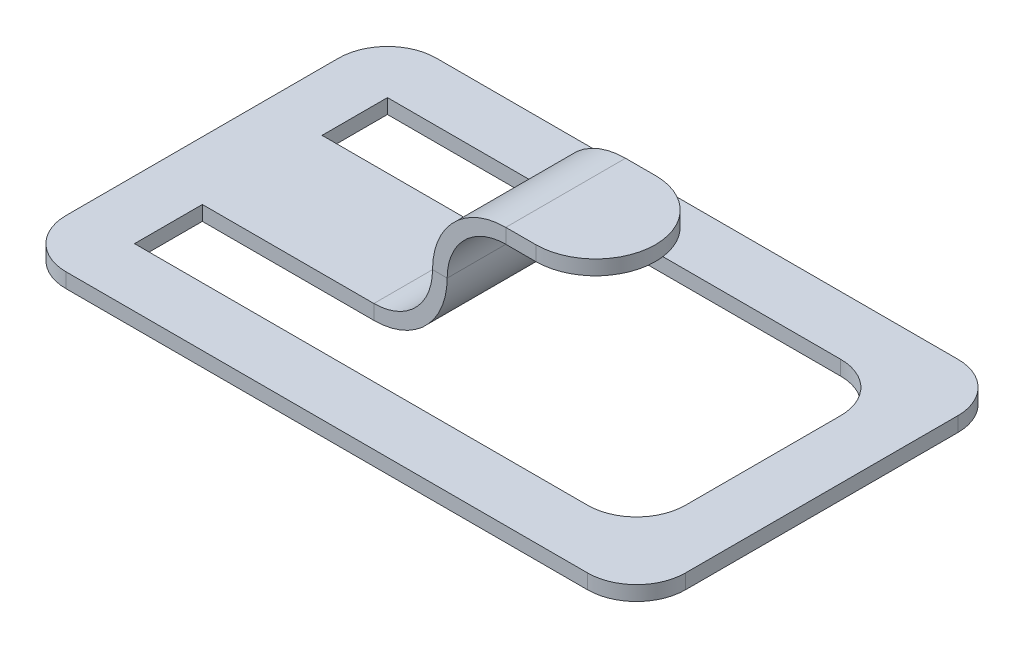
ISO-10303-21;
HEADER;
FILE_DESCRIPTION(('STEP AP214'),'2;1');
FILE_NAME('part.step','',(''),(''),'','','');
FILE_SCHEMA(('AUTOMOTIVE_DESIGN { 1 0 10303 214 1 1 1 1 }'));
ENDSEC;
DATA;
#1=APPLICATION_CONTEXT('core data for automotive mechanical design processes');
#2=APPLICATION_PROTOCOL_DEFINITION('international standard','automotive_design',2000,#1);
#3=PRODUCT_CONTEXT('',#1,'mechanical');
#4=PRODUCT('Part','Part','',(#3));
#5=PRODUCT_RELATED_PRODUCT_CATEGORY('part','',(#4));
#6=PRODUCT_DEFINITION_FORMATION('','',#4);
#7=PRODUCT_DEFINITION_CONTEXT('part definition',#1,'design');
#8=PRODUCT_DEFINITION('design','',#6,#7);
#9=PRODUCT_DEFINITION_SHAPE('','',#8);
#10=(LENGTH_UNIT() NAMED_UNIT(*) SI_UNIT(.MILLI.,.METRE.));
#11=(NAMED_UNIT(*) PLANE_ANGLE_UNIT() SI_UNIT($,.RADIAN.));
#12=(NAMED_UNIT(*) SI_UNIT($,.STERADIAN.) SOLID_ANGLE_UNIT());
#13=UNCERTAINTY_MEASURE_WITH_UNIT(LENGTH_MEASURE(1.E-05),#10,'distance_accuracy_value','');
#14=(GEOMETRIC_REPRESENTATION_CONTEXT(3) GLOBAL_UNCERTAINTY_ASSIGNED_CONTEXT((#13)) GLOBAL_UNIT_ASSIGNED_CONTEXT((#10,
#11,#12)) REPRESENTATION_CONTEXT('',''));
#15=CARTESIAN_POINT('',(0.,0.,0.));
#16=DIRECTION('',(0.,0.,1.));
#17=DIRECTION('',(1.,0.,0.));
#18=AXIS2_PLACEMENT_3D('',#15,#16,#17);
#19=CARTESIAN_POINT('',(12.,3.,-12.));
#20=DIRECTION('',(1.,0.,0.));
#21=DIRECTION('',(0.,0.,-1.));
#22=AXIS2_PLACEMENT_3D('',#19,#20,#21);
#23=PLANE('',#22);
#24=DIRECTION('',(0.,0.,1.));
#25=VECTOR('',#24,1.);
#26=CARTESIAN_POINT('',(12.,0.,-12.));
#27=LINE('',#26,#25);
#28=CARTESIAN_POINT('',(12.,0.,-25.889966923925));
#29=VERTEX_POINT('',#28);
#30=CARTESIAN_POINT('',(12.,0.,-12.));
#31=VERTEX_POINT('',#30);
#32=EDGE_CURVE('E293',#29,#31,#27,.T.);
#33=ORIENTED_EDGE('',*,*,#32,.F.);
#34=DIRECTION('',(0.,-1.,0.));
#35=VECTOR('',#34,1.);
#36=CARTESIAN_POINT('',(12.,3.,-25.889966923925));
#37=LINE('',#36,#35);
#38=CARTESIAN_POINT('',(12.,3.,-25.889966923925));
#39=VERTEX_POINT('',#38);
#40=EDGE_CURVE('E266',#39,#29,#37,.T.);
#41=ORIENTED_EDGE('',*,*,#40,.F.);
#42=DIRECTION('',(0.,0.,1.));
#43=VECTOR('',#42,1.);
#44=CARTESIAN_POINT('',(12.,3.,-12.));
#45=LINE('',#44,#43);
#46=CARTESIAN_POINT('',(12.,3.,-12.));
#47=VERTEX_POINT('',#46);
#48=EDGE_CURVE('E392',#39,#47,#45,.T.);
#49=ORIENTED_EDGE('',*,*,#48,.T.);
#50=DIRECTION('',(0.,-1.,0.));
#51=VECTOR('',#50,1.);
#52=CARTESIAN_POINT('',(12.,3.,-12.));
#53=LINE('',#52,#51);
#54=EDGE_CURVE('E390',#47,#31,#53,.T.);
#55=ORIENTED_EDGE('',*,*,#54,.T.);
#56=EDGE_LOOP('',(#33,#41,#49,#55));
#57=FACE_BOUND('',#56,.T.);
#58=ADVANCED_FACE('F39',(#57),#23,.T.);
#59=CARTESIAN_POINT('',(12.,3.,-12.));
#60=DIRECTION('',(0.,0.,-1.));
#61=DIRECTION('',(-1.,0.,0.));
#62=AXIS2_PLACEMENT_3D('',#59,#60,#61);
#63=PLANE('',#62);
#64=DIRECTION('',(1.,0.,0.));
#65=VECTOR('',#64,1.);
#66=CARTESIAN_POINT('',(12.,0.,-12.));
#67=LINE('',#66,#65);
#68=CARTESIAN_POINT('',(104.761962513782,0.,-12.));
#69=VERTEX_POINT('',#68);
#70=EDGE_CURVE('E290',#31,#69,#67,.T.);
#71=ORIENTED_EDGE('',*,*,#70,.F.);
#72=ORIENTED_EDGE('',*,*,#54,.F.);
#73=DIRECTION('',(1.,0.,0.));
#74=VECTOR('',#73,1.);
#75=CARTESIAN_POINT('',(12.,3.,-12.));
#76=LINE('',#75,#74);
#77=CARTESIAN_POINT('',(104.761962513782,3.,-12.));
#78=VERTEX_POINT('',#77);
#79=EDGE_CURVE('E388',#47,#78,#76,.T.);
#80=ORIENTED_EDGE('',*,*,#79,.T.);
#81=DIRECTION('',(0.,-1.,0.));
#82=VECTOR('',#81,1.);
#83=CARTESIAN_POINT('',(104.761962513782,3.,-12.));
#84=LINE('',#83,#82);
#85=EDGE_CURVE('E386',#78,#69,#84,.T.);
#86=ORIENTED_EDGE('',*,*,#85,.T.);
#87=EDGE_LOOP('',(#71,#72,#80,#86));
#88=FACE_BOUND('',#87,.T.);
#89=ADVANCED_FACE('F440',(#88),#63,.T.);
#90=CARTESIAN_POINT('',(104.761962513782,3.,-22.));
#91=DIRECTION('',(0.,-1.,0.));
#92=DIRECTION('',(0.,0.,-1.));
#93=AXIS2_PLACEMENT_3D('',#90,#91,#92);
#94=CYLINDRICAL_SURFACE('',#93,10.);
#95=CARTESIAN_POINT('',(104.761962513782,0.,-22.));
#96=DIRECTION('',(0.,1.,0.));
#97=DIRECTION('',(0.,0.,1.));
#98=AXIS2_PLACEMENT_3D('',#95,#96,#97);
#99=CIRCLE('',#98,10.);
#100=CARTESIAN_POINT('',(114.761962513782,0.,-22.0000000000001));
#101=VERTEX_POINT('',#100);
#102=EDGE_CURVE('E287',#69,#101,#99,.T.);
#103=ORIENTED_EDGE('',*,*,#102,.F.);
#104=ORIENTED_EDGE('',*,*,#85,.F.);
#105=CARTESIAN_POINT('',(104.761962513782,3.,-22.));
#106=DIRECTION('',(0.,1.,0.));
#107=DIRECTION('',(0.,0.,1.));
#108=AXIS2_PLACEMENT_3D('',#105,#106,#107);
#109=CIRCLE('',#108,10.);
#110=CARTESIAN_POINT('',(114.761962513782,3.,-22.0000000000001));
#111=VERTEX_POINT('',#110);
#112=EDGE_CURVE('E384',#78,#111,#109,.T.);
#113=ORIENTED_EDGE('',*,*,#112,.T.);
#114=DIRECTION('',(0.,-1.,0.));
#115=VECTOR('',#114,1.);
#116=CARTESIAN_POINT('',(114.761962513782,3.,-22.0000000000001));
#117=LINE('',#116,#115);
#118=EDGE_CURVE('E382',#111,#101,#117,.T.);
#119=ORIENTED_EDGE('',*,*,#118,.T.);
#120=EDGE_LOOP('',(#103,#104,#113,#119));
#121=FACE_BOUND('',#120,.T.);
#122=ADVANCED_FACE('F446',(#121),#94,.F.);
#123=CARTESIAN_POINT('',(114.761962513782,3.,-22.0000000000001));
#124=DIRECTION('',(-1.,0.,0.));
#125=DIRECTION('',(0.,0.,1.));
#126=AXIS2_PLACEMENT_3D('',#123,#124,#125);
#127=PLANE('',#126);
#128=DIRECTION('',(0.,0.,-1.));
#129=VECTOR('',#128,1.);
#130=CARTESIAN_POINT('',(114.761962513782,0.,-22.0000000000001));
#131=LINE('',#130,#129);
#132=CARTESIAN_POINT('',(114.761962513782,0.,-53.77993384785));
#133=VERTEX_POINT('',#132);
#134=EDGE_CURVE('E284',#101,#133,#131,.T.);
#135=ORIENTED_EDGE('',*,*,#134,.F.);
#136=ORIENTED_EDGE('',*,*,#118,.F.);
#137=DIRECTION('',(0.,0.,-1.));
#138=VECTOR('',#137,1.);
#139=CARTESIAN_POINT('',(114.761962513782,3.,-22.0000000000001));
#140=LINE('',#139,#138);
#141=CARTESIAN_POINT('',(114.761962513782,3.,-53.77993384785));
#142=VERTEX_POINT('',#141);
#143=EDGE_CURVE('E380',#111,#142,#140,.T.);
#144=ORIENTED_EDGE('',*,*,#143,.T.);
#145=DIRECTION('',(0.,-1.,0.));
#146=VECTOR('',#145,1.);
#147=CARTESIAN_POINT('',(114.761962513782,3.,-53.77993384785));
#148=LINE('',#147,#146);
#149=EDGE_CURVE('E378',#142,#133,#148,.T.);
#150=ORIENTED_EDGE('',*,*,#149,.T.);
#151=EDGE_LOOP('',(#135,#136,#144,#150));
#152=FACE_BOUND('',#151,.T.);
#153=ADVANCED_FACE('F453',(#152),#127,.T.);
#154=CARTESIAN_POINT('',(104.761962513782,3.,-53.7799338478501));
#155=DIRECTION('',(0.,-1.,0.));
#156=DIRECTION('',(0.,0.,-1.));
#157=AXIS2_PLACEMENT_3D('',#154,#155,#156);
#158=CYLINDRICAL_SURFACE('',#157,10.);
#159=CARTESIAN_POINT('',(104.761962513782,0.,-53.7799338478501));
#160=DIRECTION('',(0.,1.,0.));
#161=DIRECTION('',(0.,0.,1.));
#162=AXIS2_PLACEMENT_3D('',#159,#160,#161);
#163=CIRCLE('',#162,10.);
#164=CARTESIAN_POINT('',(104.761962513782,0.,-63.7799338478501));
#165=VERTEX_POINT('',#164);
#166=EDGE_CURVE('E281',#133,#165,#163,.T.);
#167=ORIENTED_EDGE('',*,*,#166,.F.);
#168=ORIENTED_EDGE('',*,*,#149,.F.);
#169=CARTESIAN_POINT('',(104.761962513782,3.,-53.7799338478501));
#170=DIRECTION('',(0.,1.,0.));
#171=DIRECTION('',(0.,0.,1.));
#172=AXIS2_PLACEMENT_3D('',#169,#170,#171);
#173=CIRCLE('',#172,10.);
#174=CARTESIAN_POINT('',(104.761962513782,3.,-63.7799338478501));
#175=VERTEX_POINT('',#174);
#176=EDGE_CURVE('E375',#142,#175,#173,.T.);
#177=ORIENTED_EDGE('',*,*,#176,.T.);
#178=DIRECTION('',(0.,-1.,0.));
#179=VECTOR('',#178,1.);
#180=CARTESIAN_POINT('',(104.761962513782,3.,-63.7799338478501));
#181=LINE('',#180,#179);
#182=EDGE_CURVE('E373',#175,#165,#181,.T.);
#183=ORIENTED_EDGE('',*,*,#182,.T.);
#184=EDGE_LOOP('',(#167,#168,#177,#183));
#185=FACE_BOUND('',#184,.T.);
#186=ADVANCED_FACE('F457',(#185),#158,.F.);
#187=CARTESIAN_POINT('',(12.,3.,-63.7799338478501));
#188=DIRECTION('',(0.,0.,1.));
#189=DIRECTION('',(1.,0.,0.));
#190=AXIS2_PLACEMENT_3D('',#187,#188,#189);
#191=PLANE('',#190);
#192=DIRECTION('',(-1.,0.,0.));
#193=VECTOR('',#192,1.);
#194=CARTESIAN_POINT('',(12.,0.,-63.7799338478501));
#195=LINE('',#194,#193);
#196=CARTESIAN_POINT('',(12.,0.,-63.7799338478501));
#197=VERTEX_POINT('',#196);
#198=EDGE_CURVE('E278',#165,#197,#195,.T.);
#199=ORIENTED_EDGE('',*,*,#198,.F.);
#200=ORIENTED_EDGE('',*,*,#182,.F.);
#201=DIRECTION('',(-1.,0.,0.));
#202=VECTOR('',#201,1.);
#203=CARTESIAN_POINT('',(12.,3.,-63.7799338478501));
#204=LINE('',#203,#202);
#205=CARTESIAN_POINT('',(12.,3.,-63.7799338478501));
#206=VERTEX_POINT('',#205);
#207=EDGE_CURVE('E371',#175,#206,#204,.T.);
#208=ORIENTED_EDGE('',*,*,#207,.T.);
#209=DIRECTION('',(0.,-1.,0.));
#210=VECTOR('',#209,1.);
#211=CARTESIAN_POINT('',(12.,3.,-63.7799338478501));
#212=LINE('',#211,#210);
#213=EDGE_CURVE('E368',#206,#197,#212,.T.);
#214=ORIENTED_EDGE('',*,*,#213,.T.);
#215=EDGE_LOOP('',(#199,#200,#208,#214));
#216=FACE_BOUND('',#215,.T.);
#217=ADVANCED_FACE('F461',(#216),#191,.T.);
#218=CARTESIAN_POINT('',(12.,3.,-50.3908410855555));
#219=DIRECTION('',(1.,0.,0.));
#220=DIRECTION('',(0.,0.,-1.));
#221=AXIS2_PLACEMENT_3D('',#218,#219,#220);
#222=PLANE('',#221);
#223=DIRECTION('',(0.,0.,1.));
#224=VECTOR('',#223,1.);
#225=CARTESIAN_POINT('',(12.,0.,-50.3908410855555));
#226=LINE('',#225,#224);
#227=CARTESIAN_POINT('',(12.,0.,-50.3908410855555));
#228=VERTEX_POINT('',#227);
#229=EDGE_CURVE('E275',#197,#228,#226,.T.);
#230=ORIENTED_EDGE('',*,*,#229,.F.);
#231=ORIENTED_EDGE('',*,*,#213,.F.);
#232=DIRECTION('',(0.,0.,1.));
#233=VECTOR('',#232,1.);
#234=CARTESIAN_POINT('',(12.,3.,-50.3908410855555));
#235=LINE('',#234,#233);
#236=CARTESIAN_POINT('',(12.,3.,-50.3908410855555));
#237=VERTEX_POINT('',#236);
#238=EDGE_CURVE('E366',#206,#237,#235,.T.);
#239=ORIENTED_EDGE('',*,*,#238,.T.);
#240=DIRECTION('',(0.,-1.,0.));
#241=VECTOR('',#240,1.);
#242=CARTESIAN_POINT('',(12.,3.,-50.3908410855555));
#243=LINE('',#242,#241);
#244=EDGE_CURVE('E363',#237,#228,#243,.T.);
#245=ORIENTED_EDGE('',*,*,#244,.T.);
#246=EDGE_LOOP('',(#230,#231,#239,#245));
#247=FACE_BOUND('',#246,.T.);
#248=ADVANCED_FACE('F465',(#247),#222,.T.);
#249=CARTESIAN_POINT('',(126.761962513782,3.,-10.0000000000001));
#250=DIRECTION('',(-1.,0.,0.));
#251=DIRECTION('',(0.,0.,1.));
#252=AXIS2_PLACEMENT_3D('',#249,#250,#251);
#253=PLANE('',#252);
#254=DIRECTION('',(0.,0.,-1.));
#255=VECTOR('',#254,1.);
#256=CARTESIAN_POINT('',(126.761962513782,0.,-10.0000000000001));
#257=LINE('',#256,#255);
#258=CARTESIAN_POINT('',(126.761962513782,0.,-10.0000000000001));
#259=VERTEX_POINT('',#258);
#260=CARTESIAN_POINT('',(126.761962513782,0.,-65.77993384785));
#261=VERTEX_POINT('',#260);
#262=EDGE_CURVE('E361',#259,#261,#257,.T.);
#263=ORIENTED_EDGE('',*,*,#262,.T.);
#264=DIRECTION('',(0.,-1.,0.));
#265=VECTOR('',#264,1.);
#266=CARTESIAN_POINT('',(126.761962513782,3.,-65.77993384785));
#267=LINE('',#266,#265);
#268=CARTESIAN_POINT('',(126.761962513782,3.,-65.77993384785));
#269=VERTEX_POINT('',#268);
#270=EDGE_CURVE('E322',#269,#261,#267,.T.);
#271=ORIENTED_EDGE('',*,*,#270,.F.);
#272=DIRECTION('',(0.,0.,-1.));
#273=VECTOR('',#272,1.);
#274=CARTESIAN_POINT('',(126.761962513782,3.,-10.0000000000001));
#275=LINE('',#274,#273);
#276=CARTESIAN_POINT('',(126.761962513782,3.,-10.0000000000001));
#277=VERTEX_POINT('',#276);
#278=EDGE_CURVE('E305',#277,#269,#275,.T.);
#279=ORIENTED_EDGE('',*,*,#278,.F.);
#280=DIRECTION('',(0.,-1.,0.));
#281=VECTOR('',#280,1.);
#282=CARTESIAN_POINT('',(126.761962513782,3.,-10.0000000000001));
#283=LINE('',#282,#281);
#284=EDGE_CURVE('E358',#277,#259,#283,.T.);
#285=ORIENTED_EDGE('',*,*,#284,.T.);
#286=EDGE_LOOP('',(#263,#271,#279,#285));
#287=FACE_BOUND('',#286,.T.);
#288=ADVANCED_FACE('F469',(#287),#253,.F.);
#289=CARTESIAN_POINT('',(116.761962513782,3.,-10.));
#290=DIRECTION('',(0.,-1.,0.));
#291=DIRECTION('',(0.,0.,-1.));
#292=AXIS2_PLACEMENT_3D('',#289,#290,#291);
#293=CYLINDRICAL_SURFACE('',#292,10.);
#294=CARTESIAN_POINT('',(116.761962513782,0.,-10.));
#295=DIRECTION('',(0.,1.,0.));
#296=DIRECTION('',(0.,0.,1.));
#297=AXIS2_PLACEMENT_3D('',#294,#295,#296);
#298=CIRCLE('',#297,10.);
#299=CARTESIAN_POINT('',(116.761962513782,0.,0.));
#300=VERTEX_POINT('',#299);
#301=EDGE_CURVE('E356',#300,#259,#298,.T.);
#302=ORIENTED_EDGE('',*,*,#301,.T.);
#303=ORIENTED_EDGE('',*,*,#284,.F.);
#304=CARTESIAN_POINT('',(116.761962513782,3.,-10.));
#305=DIRECTION('',(0.,1.,0.));
#306=DIRECTION('',(0.,0.,1.));
#307=AXIS2_PLACEMENT_3D('',#304,#305,#306);
#308=CIRCLE('',#307,10.);
#309=CARTESIAN_POINT('',(116.761962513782,3.,0.));
#310=VERTEX_POINT('',#309);
#311=EDGE_CURVE('E307',#310,#277,#308,.T.);
#312=ORIENTED_EDGE('',*,*,#311,.F.);
#313=DIRECTION('',(0.,-1.,0.));
#314=VECTOR('',#313,1.);
#315=CARTESIAN_POINT('',(116.761962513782,3.,0.));
#316=LINE('',#315,#314);
#317=EDGE_CURVE('E353',#310,#300,#316,.T.);
#318=ORIENTED_EDGE('',*,*,#317,.T.);
#319=EDGE_LOOP('',(#302,#303,#312,#318));
#320=FACE_BOUND('',#319,.T.);
#321=ADVANCED_FACE('F473',(#320),#293,.T.);
#322=CARTESIAN_POINT('',(10.0000000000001,3.,0.));
#323=DIRECTION('',(0.,0.,-1.));
#324=DIRECTION('',(-1.,0.,0.));
#325=AXIS2_PLACEMENT_3D('',#322,#323,#324);
#326=PLANE('',#325);
#327=DIRECTION('',(1.,0.,0.));
#328=VECTOR('',#327,1.);
#329=CARTESIAN_POINT('',(10.0000000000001,0.,0.));
#330=LINE('',#329,#328);
#331=CARTESIAN_POINT('',(10.0000000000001,0.,0.));
#332=VERTEX_POINT('',#331);
#333=EDGE_CURVE('E351',#332,#300,#330,.T.);
#334=ORIENTED_EDGE('',*,*,#333,.T.);
#335=ORIENTED_EDGE('',*,*,#317,.F.);
#336=DIRECTION('',(1.,0.,0.));
#337=VECTOR('',#336,1.);
#338=CARTESIAN_POINT('',(10.0000000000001,3.,0.));
#339=LINE('',#338,#337);
#340=CARTESIAN_POINT('',(10.0000000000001,3.,0.));
#341=VERTEX_POINT('',#340);
#342=EDGE_CURVE('E309',#341,#310,#339,.T.);
#343=ORIENTED_EDGE('',*,*,#342,.F.);
#344=DIRECTION('',(0.,-1.,0.));
#345=VECTOR('',#344,1.);
#346=CARTESIAN_POINT('',(10.0000000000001,3.,0.));
#347=LINE('',#346,#345);
#348=EDGE_CURVE('E348',#341,#332,#347,.T.);
#349=ORIENTED_EDGE('',*,*,#348,.T.);
#350=EDGE_LOOP('',(#334,#335,#343,#349));
#351=FACE_BOUND('',#350,.T.);
#352=ADVANCED_FACE('F477',(#351),#326,.F.);
#353=CARTESIAN_POINT('',(10.,3.,-10.));
#354=DIRECTION('',(0.,-1.,0.));
#355=DIRECTION('',(0.,0.,-1.));
#356=AXIS2_PLACEMENT_3D('',#353,#354,#355);
#357=CYLINDRICAL_SURFACE('',#356,10.);
#358=CARTESIAN_POINT('',(10.,0.,-10.));
#359=DIRECTION('',(0.,1.,0.));
#360=DIRECTION('',(0.,0.,-1.));
#361=AXIS2_PLACEMENT_3D('',#358,#359,#360);
#362=CIRCLE('',#361,10.);
#363=CARTESIAN_POINT('',(0.,0.,-10.0000000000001));
#364=VERTEX_POINT('',#363);
#365=EDGE_CURVE('E346',#364,#332,#362,.T.);
#366=ORIENTED_EDGE('',*,*,#365,.T.);
#367=ORIENTED_EDGE('',*,*,#348,.F.);
#368=CARTESIAN_POINT('',(10.,3.,-10.));
#369=DIRECTION('',(0.,1.,0.));
#370=DIRECTION('',(0.,0.,-1.));
#371=AXIS2_PLACEMENT_3D('',#368,#369,#370);
#372=CIRCLE('',#371,10.);
#373=CARTESIAN_POINT('',(0.,3.,-10.0000000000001));
#374=VERTEX_POINT('',#373);
#375=EDGE_CURVE('E311',#374,#341,#372,.T.);
#376=ORIENTED_EDGE('',*,*,#375,.F.);
#377=DIRECTION('',(0.,-1.,0.));
#378=VECTOR('',#377,1.);
#379=CARTESIAN_POINT('',(0.,3.,-10.0000000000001));
#380=LINE('',#379,#378);
#381=EDGE_CURVE('E343',#374,#364,#380,.T.);
#382=ORIENTED_EDGE('',*,*,#381,.T.);
#383=EDGE_LOOP('',(#366,#367,#376,#382));
#384=FACE_BOUND('',#383,.T.);
#385=ADVANCED_FACE('F481',(#384),#357,.T.);
#386=CARTESIAN_POINT('',(0.,3.,-10.0000000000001));
#387=DIRECTION('',(1.,0.,0.));
#388=DIRECTION('',(0.,0.,-1.));
#389=AXIS2_PLACEMENT_3D('',#386,#387,#388);
#390=PLANE('',#389);
#391=DIRECTION('',(0.,0.,1.));
#392=VECTOR('',#391,1.);
#393=CARTESIAN_POINT('',(0.,0.,-10.0000000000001));
#394=LINE('',#393,#392);
#395=CARTESIAN_POINT('',(0.,0.,-65.77993384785));
#396=VERTEX_POINT('',#395);
#397=EDGE_CURVE('E341',#396,#364,#394,.T.);
#398=ORIENTED_EDGE('',*,*,#397,.T.);
#399=ORIENTED_EDGE('',*,*,#381,.F.);
#400=DIRECTION('',(0.,0.,1.));
#401=VECTOR('',#400,1.);
#402=CARTESIAN_POINT('',(0.,3.,-10.0000000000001));
#403=LINE('',#402,#401);
#404=CARTESIAN_POINT('',(0.,3.,-65.77993384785));
#405=VERTEX_POINT('',#404);
#406=EDGE_CURVE('E313',#405,#374,#403,.T.);
#407=ORIENTED_EDGE('',*,*,#406,.F.);
#408=DIRECTION('',(0.,-1.,0.));
#409=VECTOR('',#408,1.);
#410=CARTESIAN_POINT('',(0.,3.,-65.77993384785));
#411=LINE('',#410,#409);
#412=EDGE_CURVE('E338',#405,#396,#411,.T.);
#413=ORIENTED_EDGE('',*,*,#412,.T.);
#414=EDGE_LOOP('',(#398,#399,#407,#413));
#415=FACE_BOUND('',#414,.T.);
#416=ADVANCED_FACE('F485',(#415),#390,.F.);
#417=CARTESIAN_POINT('',(10.,3.,-65.7799338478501));
#418=DIRECTION('',(0.,-1.,0.));
#419=DIRECTION('',(0.,0.,-1.));
#420=AXIS2_PLACEMENT_3D('',#417,#418,#419);
#421=CYLINDRICAL_SURFACE('',#420,10.);
#422=CARTESIAN_POINT('',(10.,0.,-65.7799338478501));
#423=DIRECTION('',(0.,1.,0.));
#424=DIRECTION('',(0.,0.,-1.));
#425=AXIS2_PLACEMENT_3D('',#422,#423,#424);
#426=CIRCLE('',#425,10.);
#427=CARTESIAN_POINT('',(10.0000000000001,0.,-75.7799338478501));
#428=VERTEX_POINT('',#427);
#429=EDGE_CURVE('E336',#428,#396,#426,.T.);
#430=ORIENTED_EDGE('',*,*,#429,.T.);
#431=ORIENTED_EDGE('',*,*,#412,.F.);
#432=CARTESIAN_POINT('',(10.,3.,-65.7799338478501));
#433=DIRECTION('',(0.,1.,0.));
#434=DIRECTION('',(0.,0.,-1.));
#435=AXIS2_PLACEMENT_3D('',#432,#433,#434);
#436=CIRCLE('',#435,10.);
#437=CARTESIAN_POINT('',(10.0000000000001,3.,-75.7799338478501));
#438=VERTEX_POINT('',#437);
#439=EDGE_CURVE('E315',#438,#405,#436,.T.);
#440=ORIENTED_EDGE('',*,*,#439,.F.);
#441=DIRECTION('',(0.,-1.,0.));
#442=VECTOR('',#441,1.);
#443=CARTESIAN_POINT('',(10.0000000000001,3.,-75.7799338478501));
#444=LINE('',#443,#442);
#445=EDGE_CURVE('E333',#438,#428,#444,.T.);
#446=ORIENTED_EDGE('',*,*,#445,.T.);
#447=EDGE_LOOP('',(#430,#431,#440,#446));
#448=FACE_BOUND('',#447,.T.);
#449=ADVANCED_FACE('F489',(#448),#421,.T.);
#450=CARTESIAN_POINT('',(10.0000000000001,3.,-75.7799338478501));
#451=DIRECTION('',(0.,0.,1.));
#452=DIRECTION('',(1.,0.,0.));
#453=AXIS2_PLACEMENT_3D('',#450,#451,#452);
#454=PLANE('',#453);
#455=DIRECTION('',(-1.,0.,0.));
#456=VECTOR('',#455,1.);
#457=CARTESIAN_POINT('',(10.0000000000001,0.,-75.7799338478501));
#458=LINE('',#457,#456);
#459=CARTESIAN_POINT('',(116.761962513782,0.,-75.7799338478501));
#460=VERTEX_POINT('',#459);
#461=EDGE_CURVE('E331',#460,#428,#458,.T.);
#462=ORIENTED_EDGE('',*,*,#461,.T.);
#463=ORIENTED_EDGE('',*,*,#445,.F.);
#464=DIRECTION('',(-1.,0.,0.));
#465=VECTOR('',#464,1.);
#466=CARTESIAN_POINT('',(10.0000000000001,3.,-75.7799338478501));
#467=LINE('',#466,#465);
#468=CARTESIAN_POINT('',(116.761962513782,3.,-75.7799338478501));
#469=VERTEX_POINT('',#468);
#470=EDGE_CURVE('E317',#469,#438,#467,.T.);
#471=ORIENTED_EDGE('',*,*,#470,.F.);
#472=DIRECTION('',(0.,-1.,0.));
#473=VECTOR('',#472,1.);
#474=CARTESIAN_POINT('',(116.761962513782,3.,-75.7799338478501));
#475=LINE('',#474,#473);
#476=EDGE_CURVE('E328',#469,#460,#475,.T.);
#477=ORIENTED_EDGE('',*,*,#476,.T.);
#478=EDGE_LOOP('',(#462,#463,#471,#477));
#479=FACE_BOUND('',#478,.T.);
#480=ADVANCED_FACE('F493',(#479),#454,.F.);
#481=CARTESIAN_POINT('',(116.761962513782,3.,-65.7799338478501));
#482=DIRECTION('',(0.,-1.,0.));
#483=DIRECTION('',(0.,0.,-1.));
#484=AXIS2_PLACEMENT_3D('',#481,#482,#483);
#485=CYLINDRICAL_SURFACE('',#484,9.99999999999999);
#486=CARTESIAN_POINT('',(116.761962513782,0.,-65.7799338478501));
#487=DIRECTION('',(0.,1.,0.));
#488=DIRECTION('',(0.,0.,1.));
#489=AXIS2_PLACEMENT_3D('',#486,#487,#488);
#490=CIRCLE('',#489,9.99999999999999);
#491=EDGE_CURVE('E325',#261,#460,#490,.T.);
#492=ORIENTED_EDGE('',*,*,#491,.T.);
#493=ORIENTED_EDGE('',*,*,#476,.F.);
#494=CARTESIAN_POINT('',(116.761962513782,3.,-65.7799338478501));
#495=DIRECTION('',(0.,1.,0.));
#496=DIRECTION('',(0.,0.,1.));
#497=AXIS2_PLACEMENT_3D('',#494,#495,#496);
#498=CIRCLE('',#497,9.99999999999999);
#499=EDGE_CURVE('E319',#269,#469,#498,.T.);
#500=ORIENTED_EDGE('',*,*,#499,.F.);
#501=ORIENTED_EDGE('',*,*,#270,.T.);
#502=EDGE_LOOP('',(#492,#493,#500,#501));
#503=FACE_BOUND('',#502,.T.);
#504=ADVANCED_FACE('F497',(#503),#485,.T.);
#505=CARTESIAN_POINT('',(116.761962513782,3.,-65.7799338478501));
#506=DIRECTION('',(0.,1.,0.));
#507=DIRECTION('',(0.,0.,1.));
#508=AXIS2_PLACEMENT_3D('',#505,#506,#507);
#509=PLANE('',#508);
#510=ORIENTED_EDGE('',*,*,#499,.T.);
#511=ORIENTED_EDGE('',*,*,#470,.T.);
#512=ORIENTED_EDGE('',*,*,#439,.T.);
#513=ORIENTED_EDGE('',*,*,#406,.T.);
#514=ORIENTED_EDGE('',*,*,#375,.T.);
#515=ORIENTED_EDGE('',*,*,#342,.T.);
#516=ORIENTED_EDGE('',*,*,#311,.T.);
#517=ORIENTED_EDGE('',*,*,#278,.T.);
#518=EDGE_LOOP('',(#510,#511,#512,#513,#514,#515,#516,#517));
#519=FACE_BOUND('',#518,.T.);
#520=DIRECTION('',(-1.,0.,0.));
#521=VECTOR('',#520,1.);
#522=CARTESIAN_POINT('',(12.,3.,-25.889966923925));
#523=LINE('',#522,#521);
#524=CARTESIAN_POINT('',(47.1115981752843,2.99999996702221,-25.889966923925));
#525=VERTEX_POINT('',#524);
#526=EDGE_CURVE('E62',#525,#39,#523,.T.);
#527=ORIENTED_EDGE('',*,*,#526,.F.);
#528=DIRECTION('',(0.,0.,-1.));
#529=VECTOR('',#528,1.);
#530=CARTESIAN_POINT('',(47.1115981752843,3.,-65.7799338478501));
#531=LINE('',#530,#529);
#532=CARTESIAN_POINT('',(47.1115981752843,2.99999996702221,-50.3908410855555));
#533=VERTEX_POINT('',#532);
#534=EDGE_CURVE('E173',#525,#533,#531,.T.);
#535=ORIENTED_EDGE('',*,*,#534,.T.);
#536=DIRECTION('',(1.,0.,0.));
#537=VECTOR('',#536,1.);
#538=CARTESIAN_POINT('',(12.,3.,-50.3908410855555));
#539=LINE('',#538,#537);
#540=EDGE_CURVE('E301',#237,#533,#539,.T.);
#541=ORIENTED_EDGE('',*,*,#540,.F.);
#542=ORIENTED_EDGE('',*,*,#238,.F.);
#543=ORIENTED_EDGE('',*,*,#207,.F.);
#544=ORIENTED_EDGE('',*,*,#176,.F.);
#545=ORIENTED_EDGE('',*,*,#143,.F.);
#546=ORIENTED_EDGE('',*,*,#112,.F.);
#547=ORIENTED_EDGE('',*,*,#79,.F.);
#548=ORIENTED_EDGE('',*,*,#48,.F.);
#549=EDGE_LOOP('',(#527,#535,#541,#542,#543,#544,#545,#546,#547,#548));
#550=FACE_BOUND('',#549,.T.);
#551=ADVANCED_FACE('F501',(#519,#550),#509,.T.);
#552=CARTESIAN_POINT('',(12.,3.,-50.3908410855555));
#553=DIRECTION('',(0.,0.,-1.));
#554=DIRECTION('',(-1.,0.,0.));
#555=AXIS2_PLACEMENT_3D('',#552,#553,#554);
#556=PLANE('',#555);
#557=ORIENTED_EDGE('',*,*,#540,.T.);
#558=DIRECTION('',(0.,-1.,0.));
#559=VECTOR('',#558,1.);
#560=CARTESIAN_POINT('',(47.1115981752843,3.,-50.3908410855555));
#561=LINE('',#560,#559);
#562=CARTESIAN_POINT('',(47.1115981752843,0.,-50.3908410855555));
#563=VERTEX_POINT('',#562);
#564=EDGE_CURVE('E298',#533,#563,#561,.T.);
#565=ORIENTED_EDGE('',*,*,#564,.T.);
#566=DIRECTION('',(1.,0.,0.));
#567=VECTOR('',#566,1.);
#568=CARTESIAN_POINT('',(12.,0.,-50.3908410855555));
#569=LINE('',#568,#567);
#570=EDGE_CURVE('E272',#228,#563,#569,.T.);
#571=ORIENTED_EDGE('',*,*,#570,.F.);
#572=ORIENTED_EDGE('',*,*,#244,.F.);
#573=EDGE_LOOP('',(#557,#565,#571,#572));
#574=FACE_BOUND('',#573,.T.);
#575=ADVANCED_FACE('F505',(#574),#556,.T.);
#576=CARTESIAN_POINT('',(116.761962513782,0.,-65.7799338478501));
#577=DIRECTION('',(0.,1.,0.));
#578=DIRECTION('',(0.,0.,1.));
#579=AXIS2_PLACEMENT_3D('',#576,#577,#578);
#580=PLANE('',#579);
#581=DIRECTION('',(0.,0.,-1.));
#582=VECTOR('',#581,1.);
#583=CARTESIAN_POINT('',(47.1115981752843,0.,-65.7799338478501));
#584=LINE('',#583,#582);
#585=CARTESIAN_POINT('',(47.1115981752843,-3.29777906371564E-08,-25.889966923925));
#586=VERTEX_POINT('',#585);
#587=EDGE_CURVE('E262',#586,#563,#584,.T.);
#588=ORIENTED_EDGE('',*,*,#587,.F.);
#589=DIRECTION('',(-1.,0.,0.));
#590=VECTOR('',#589,1.);
#591=CARTESIAN_POINT('',(12.,0.,-25.889966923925));
#592=LINE('',#591,#590);
#593=EDGE_CURVE('E296',#586,#29,#592,.T.);
#594=ORIENTED_EDGE('',*,*,#593,.T.);
#595=ORIENTED_EDGE('',*,*,#32,.T.);
#596=ORIENTED_EDGE('',*,*,#70,.T.);
#597=ORIENTED_EDGE('',*,*,#102,.T.);
#598=ORIENTED_EDGE('',*,*,#134,.T.);
#599=ORIENTED_EDGE('',*,*,#166,.T.);
#600=ORIENTED_EDGE('',*,*,#198,.T.);
#601=ORIENTED_EDGE('',*,*,#229,.T.);
#602=ORIENTED_EDGE('',*,*,#570,.T.);
#603=EDGE_LOOP('',(#588,#594,#595,#596,#597,#598,#599,#600,#601,#602));
#604=FACE_BOUND('',#603,.T.);
#605=ORIENTED_EDGE('',*,*,#491,.F.);
#606=ORIENTED_EDGE('',*,*,#262,.F.);
#607=ORIENTED_EDGE('',*,*,#301,.F.);
#608=ORIENTED_EDGE('',*,*,#333,.F.);
#609=ORIENTED_EDGE('',*,*,#365,.F.);
#610=ORIENTED_EDGE('',*,*,#397,.F.);
#611=ORIENTED_EDGE('',*,*,#429,.F.);
#612=ORIENTED_EDGE('',*,*,#461,.F.);
#613=EDGE_LOOP('',(#605,#606,#607,#608,#609,#610,#611,#612));
#614=FACE_BOUND('',#613,.T.);
#615=ADVANCED_FACE('F508',(#604,#614),#580,.F.);
#616=CARTESIAN_POINT('',(12.,3.,-25.889966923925));
#617=DIRECTION('',(0.,0.,1.));
#618=DIRECTION('',(1.,0.,0.));
#619=AXIS2_PLACEMENT_3D('',#616,#617,#618);
#620=PLANE('',#619);
#621=ORIENTED_EDGE('',*,*,#593,.F.);
#622=DIRECTION('',(0.,1.,0.));
#623=VECTOR('',#622,1.);
#624=CARTESIAN_POINT('',(47.1115981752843,3.,-25.889966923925));
#625=LINE('',#624,#623);
#626=EDGE_CURVE('E270',#586,#525,#625,.T.);
#627=ORIENTED_EDGE('',*,*,#626,.T.);
#628=ORIENTED_EDGE('',*,*,#526,.T.);
#629=ORIENTED_EDGE('',*,*,#40,.T.);
#630=EDGE_LOOP('',(#621,#627,#628,#629));
#631=FACE_BOUND('',#630,.T.);
#632=ADVANCED_FACE('F41',(#631),#620,.T.);
#633=CARTESIAN_POINT('',(47.1115981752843,15.0000000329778,-25.889966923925));
#634=DIRECTION('',(0.,0.,-1.));
#635=DIRECTION('',(-1.,0.,0.));
#636=AXIS2_PLACEMENT_3D('',#633,#634,#635);
#637=PLANE('',#636);
#638=ORIENTED_EDGE('',*,*,#626,.F.);
#639=CARTESIAN_POINT('',(47.1115981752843,15.,-25.889966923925));
#640=DIRECTION('',(0.,0.,-1.));
#641=DIRECTION('',(-1.,0.,0.));
#642=AXIS2_PLACEMENT_3D('',#639,#640,#641);
#643=CIRCLE('',#642,15.0000000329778);
#644=CARTESIAN_POINT('',(62.1115981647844,15.,-25.889966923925));
#645=VERTEX_POINT('',#644);
#646=EDGE_CURVE('E254',#586,#645,#643,.F.);
#647=ORIENTED_EDGE('',*,*,#646,.T.);
#648=DIRECTION('',(-1.,0.,0.));
#649=VECTOR('',#648,1.);
#650=CARTESIAN_POINT('',(59.1115981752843,15.,-25.889966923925));
#651=LINE('',#650,#649);
#652=CARTESIAN_POINT('',(59.1115981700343,15.,-25.889966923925));
#653=VERTEX_POINT('',#652);
#654=EDGE_CURVE('E397',#645,#653,#651,.T.);
#655=ORIENTED_EDGE('',*,*,#654,.T.);
#656=CARTESIAN_POINT('',(47.1115981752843,15.0000000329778,-25.889966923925));
#657=DIRECTION('',(0.,0.,1.));
#658=DIRECTION('',(-1.,0.,0.));
#659=AXIS2_PLACEMENT_3D('',#656,#657,#658);
#660=CIRCLE('',#659,12.0000000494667);
#661=EDGE_CURVE('E258',#525,#653,#660,.T.);
#662=ORIENTED_EDGE('',*,*,#661,.F.);
#663=EDGE_LOOP('',(#638,#647,#655,#662));
#664=FACE_BOUND('',#663,.T.);
#665=ADVANCED_FACE('F401',(#664),#637,.F.);
#666=CARTESIAN_POINT('',(47.1115981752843,15.0000000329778,-50.3908410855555));
#667=DIRECTION('',(0.,0.,1.));
#668=DIRECTION('',(1.,0.,0.));
#669=AXIS2_PLACEMENT_3D('',#666,#667,#668);
#670=PLANE('',#669);
#671=CARTESIAN_POINT('',(47.1115981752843,15.,-50.3908410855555));
#672=DIRECTION('',(0.,0.,-1.));
#673=DIRECTION('',(-1.,0.,0.));
#674=AXIS2_PLACEMENT_3D('',#671,#672,#673);
#675=CIRCLE('',#674,15.0000000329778);
#676=CARTESIAN_POINT('',(62.1115981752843,15.0000000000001,-50.3908410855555));
#677=VERTEX_POINT('',#676);
#678=EDGE_CURVE('E165',#677,#563,#675,.T.);
#679=ORIENTED_EDGE('',*,*,#678,.T.);
#680=ORIENTED_EDGE('',*,*,#564,.F.);
#681=CARTESIAN_POINT('',(47.1115981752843,15.0000000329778,-50.3908410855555));
#682=DIRECTION('',(0.,0.,-1.));
#683=DIRECTION('',(1.,0.,0.));
#684=AXIS2_PLACEMENT_3D('',#681,#682,#683);
#685=CIRCLE('',#684,12.0000000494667);
#686=CARTESIAN_POINT('',(59.1115981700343,15.0000000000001,-50.3908410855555));
#687=VERTEX_POINT('',#686);
#688=EDGE_CURVE('E260',#687,#533,#685,.T.);
#689=ORIENTED_EDGE('',*,*,#688,.F.);
#690=DIRECTION('',(1.,0.,0.));
#691=VECTOR('',#690,1.);
#692=CARTESIAN_POINT('',(59.1115981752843,15.,-50.3908410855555));
#693=LINE('',#692,#691);
#694=EDGE_CURVE('E12',#687,#677,#693,.T.);
#695=ORIENTED_EDGE('',*,*,#694,.T.);
#696=EDGE_LOOP('',(#679,#680,#689,#695));
#697=FACE_BOUND('',#696,.T.);
#698=ADVANCED_FACE('F427',(#697),#670,.F.);
#699=CARTESIAN_POINT('',(47.1115981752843,15.,-4.33990787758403));
#700=DIRECTION('',(0.,0.,-1.));
#701=DIRECTION('',(-1.,0.,0.));
#702=AXIS2_PLACEMENT_3D('',#699,#700,#701);
#703=CYLINDRICAL_SURFACE('',#702,12.0000000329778);
#704=DIRECTION('',(0.,0.,-1.));
#705=VECTOR('',#704,1.);
#706=CARTESIAN_POINT('',(59.1115981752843,15.,-65.7799338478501));
#707=LINE('',#706,#705);
#708=EDGE_CURVE('E268',#653,#687,#707,.T.);
#709=ORIENTED_EDGE('',*,*,#708,.T.);
#710=ORIENTED_EDGE('',*,*,#688,.T.);
#711=ORIENTED_EDGE('',*,*,#534,.F.);
#712=ORIENTED_EDGE('',*,*,#661,.T.);
#713=EDGE_LOOP('',(#709,#710,#711,#712));
#714=FACE_BOUND('',#713,.T.);
#715=ADVANCED_FACE('F424',(#714),#703,.F.);
#716=CARTESIAN_POINT('',(47.1115981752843,15.,-4.33990787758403));
#717=DIRECTION('',(0.,0.,-1.));
#718=DIRECTION('',(-1.,0.,0.));
#719=AXIS2_PLACEMENT_3D('',#716,#717,#718);
#720=CYLINDRICAL_SURFACE('',#719,15.0000000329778);
#721=DIRECTION('',(0.,0.,-1.));
#722=VECTOR('',#721,1.);
#723=CARTESIAN_POINT('',(62.1115981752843,15.0000000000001,-65.7799338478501));
#724=LINE('',#723,#722);
#725=EDGE_CURVE('E47',#645,#677,#724,.T.);
#726=ORIENTED_EDGE('',*,*,#725,.F.);
#727=ORIENTED_EDGE('',*,*,#646,.F.);
#728=ORIENTED_EDGE('',*,*,#587,.T.);
#729=ORIENTED_EDGE('',*,*,#678,.F.);
#730=EDGE_LOOP('',(#726,#727,#728,#729));
#731=FACE_BOUND('',#730,.T.);
#732=ADVANCED_FACE('F426',(#731),#720,.T.);
#733=CARTESIAN_POINT('',(74.1115981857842,15.0000000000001,-25.889966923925));
#734=DIRECTION('',(0.,0.,1.));
#735=DIRECTION('',(1.,0.,0.));
#736=AXIS2_PLACEMENT_3D('',#733,#734,#735);
#737=PLANE('',#736);
#738=ORIENTED_EDGE('',*,*,#654,.F.);
#739=CARTESIAN_POINT('',(74.1115981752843,15.0000000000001,-25.889966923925));
#740=DIRECTION('',(0.,0.,-1.));
#741=DIRECTION('',(-1.,0.,0.));
#742=AXIS2_PLACEMENT_3D('',#739,#740,#741);
#743=CIRCLE('',#742,12.0000000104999);
#744=CARTESIAN_POINT('',(74.1115981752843,27.0000000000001,-25.889966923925));
#745=VERTEX_POINT('',#744);
#746=EDGE_CURVE('E231',#645,#745,#743,.T.);
#747=ORIENTED_EDGE('',*,*,#746,.T.);
#748=DIRECTION('',(0.,1.,0.));
#749=VECTOR('',#748,1.);
#750=CARTESIAN_POINT('',(74.1115981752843,30.0000000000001,-25.889966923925));
#751=LINE('',#750,#749);
#752=CARTESIAN_POINT('',(74.1115981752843,30.0000000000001,-25.889966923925));
#753=VERTEX_POINT('',#752);
#754=EDGE_CURVE('E237',#745,#753,#751,.T.);
#755=ORIENTED_EDGE('',*,*,#754,.T.);
#756=CARTESIAN_POINT('',(74.1115981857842,15.0000000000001,-25.889966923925));
#757=DIRECTION('',(0.,0.,-1.));
#758=DIRECTION('',(1.,0.,0.));
#759=AXIS2_PLACEMENT_3D('',#756,#757,#758);
#760=CIRCLE('',#759,15.0000000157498);
#761=EDGE_CURVE('E247',#653,#753,#760,.T.);
#762=ORIENTED_EDGE('',*,*,#761,.F.);
#763=EDGE_LOOP('',(#738,#747,#755,#762));
#764=FACE_BOUND('',#763,.T.);
#765=ADVANCED_FACE('F404',(#764),#737,.T.);
#766=CARTESIAN_POINT('',(74.1115981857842,15.0000000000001,-50.3908410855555));
#767=DIRECTION('',(0.,0.,-1.));
#768=DIRECTION('',(-1.,0.,0.));
#769=AXIS2_PLACEMENT_3D('',#766,#767,#768);
#770=PLANE('',#769);
#771=DIRECTION('',(0.,-1.,0.));
#772=VECTOR('',#771,1.);
#773=CARTESIAN_POINT('',(74.1115981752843,30.0000000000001,-50.3908410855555));
#774=LINE('',#773,#772);
#775=CARTESIAN_POINT('',(74.1115982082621,30.0000000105,-50.3908410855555));
#776=VERTEX_POINT('',#775);
#777=CARTESIAN_POINT('',(74.1115981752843,27.0000000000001,-50.3908410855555));
#778=VERTEX_POINT('',#777);
#779=EDGE_CURVE('E218',#776,#778,#774,.T.);
#780=ORIENTED_EDGE('',*,*,#779,.T.);
#781=CARTESIAN_POINT('',(74.1115981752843,15.0000000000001,-50.3908410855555));
#782=DIRECTION('',(0.,0.,-1.));
#783=DIRECTION('',(-1.,0.,0.));
#784=AXIS2_PLACEMENT_3D('',#781,#782,#783);
#785=CIRCLE('',#784,12.0000000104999);
#786=EDGE_CURVE('E251',#778,#677,#785,.F.);
#787=ORIENTED_EDGE('',*,*,#786,.T.);
#788=ORIENTED_EDGE('',*,*,#694,.F.);
#789=CARTESIAN_POINT('',(74.1115981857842,15.0000000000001,-50.3908410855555));
#790=DIRECTION('',(0.,0.,1.));
#791=DIRECTION('',(-1.,0.,0.));
#792=AXIS2_PLACEMENT_3D('',#789,#790,#791);
#793=CIRCLE('',#792,15.0000000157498);
#794=EDGE_CURVE('E250',#776,#687,#793,.T.);
#795=ORIENTED_EDGE('',*,*,#794,.F.);
#796=EDGE_LOOP('',(#780,#787,#788,#795));
#797=FACE_BOUND('',#796,.T.);
#798=ADVANCED_FACE('F545',(#797),#770,.T.);
#799=CARTESIAN_POINT('',(74.1115981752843,15.0000000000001,-4.339907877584));
#800=DIRECTION('',(0.,0.,-1.));
#801=DIRECTION('',(-1.,0.,0.));
#802=AXIS2_PLACEMENT_3D('',#799,#800,#801);
#803=CYLINDRICAL_SURFACE('',#802,15.0000000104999);
#804=ORIENTED_EDGE('',*,*,#794,.T.);
#805=ORIENTED_EDGE('',*,*,#708,.F.);
#806=ORIENTED_EDGE('',*,*,#761,.T.);
#807=DIRECTION('',(0.,0.,-1.));
#808=VECTOR('',#807,1.);
#809=CARTESIAN_POINT('',(74.1115981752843,30.0000000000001,-65.7799338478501));
#810=LINE('',#809,#808);
#811=EDGE_CURVE('E245',#753,#776,#810,.T.);
#812=ORIENTED_EDGE('',*,*,#811,.T.);
#813=EDGE_LOOP('',(#804,#805,#806,#812));
#814=FACE_BOUND('',#813,.T.);
#815=ADVANCED_FACE('F421',(#814),#803,.T.);
#816=CARTESIAN_POINT('',(74.1115981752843,15.0000000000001,-4.339907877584));
#817=DIRECTION('',(0.,0.,-1.));
#818=DIRECTION('',(-1.,0.,0.));
#819=AXIS2_PLACEMENT_3D('',#816,#817,#818);
#820=CYLINDRICAL_SURFACE('',#819,12.0000000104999);
#821=ORIENTED_EDGE('',*,*,#786,.F.);
#822=DIRECTION('',(0.,0.,-1.));
#823=VECTOR('',#822,1.);
#824=CARTESIAN_POINT('',(74.1115981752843,27.0000000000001,-65.7799338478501));
#825=LINE('',#824,#823);
#826=EDGE_CURVE('E409',#745,#778,#825,.T.);
#827=ORIENTED_EDGE('',*,*,#826,.F.);
#828=ORIENTED_EDGE('',*,*,#746,.F.);
#829=ORIENTED_EDGE('',*,*,#725,.T.);
#830=EDGE_LOOP('',(#821,#827,#828,#829));
#831=FACE_BOUND('',#830,.T.);
#832=ADVANCED_FACE('F407',(#831),#820,.F.);
#833=CARTESIAN_POINT('',(80.2466372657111,30.0000000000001,-38.1404040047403));
#834=DIRECTION('',(0.,-1.,0.));
#835=DIRECTION('',(0.,0.,-1.));
#836=AXIS2_PLACEMENT_3D('',#833,#834,#835);
#837=CYLINDRICAL_SURFACE('',#836,12.2504370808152);
#838=CARTESIAN_POINT('',(80.2466372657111,27.0000000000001,-38.1404040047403));
#839=DIRECTION('',(0.,-1.,0.));
#840=DIRECTION('',(0.,0.,1.));
#841=AXIS2_PLACEMENT_3D('',#838,#839,#840);
#842=CIRCLE('',#841,12.2504370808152);
#843=CARTESIAN_POINT('',(80.2466372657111,27.0000000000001,-50.3908410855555));
#844=VERTEX_POINT('',#843);
#845=CARTESIAN_POINT('',(80.2466372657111,27.0000000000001,-25.889966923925));
#846=VERTEX_POINT('',#845);
#847=EDGE_CURVE('E222',#844,#846,#842,.T.);
#848=ORIENTED_EDGE('',*,*,#847,.F.);
#849=DIRECTION('',(0.,-1.,0.));
#850=VECTOR('',#849,1.);
#851=CARTESIAN_POINT('',(80.2466372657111,30.0000000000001,-50.3908410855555));
#852=LINE('',#851,#850);
#853=CARTESIAN_POINT('',(80.2466372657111,30.0000000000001,-50.3908410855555));
#854=VERTEX_POINT('',#853);
#855=EDGE_CURVE('E215',#854,#844,#852,.T.);
#856=ORIENTED_EDGE('',*,*,#855,.F.);
#857=CARTESIAN_POINT('',(80.2466372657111,30.0000000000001,-38.1404040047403));
#858=DIRECTION('',(0.,-1.,0.));
#859=DIRECTION('',(0.,0.,1.));
#860=AXIS2_PLACEMENT_3D('',#857,#858,#859);
#861=CIRCLE('',#860,12.2504370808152);
#862=CARTESIAN_POINT('',(80.2466372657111,30.0000000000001,-25.889966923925));
#863=VERTEX_POINT('',#862);
#864=EDGE_CURVE('E228',#854,#863,#861,.T.);
#865=ORIENTED_EDGE('',*,*,#864,.T.);
#866=DIRECTION('',(0.,-1.,0.));
#867=VECTOR('',#866,1.);
#868=CARTESIAN_POINT('',(80.2466372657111,30.0000000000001,-25.889966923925));
#869=LINE('',#868,#867);
#870=EDGE_CURVE('E236',#863,#846,#869,.T.);
#871=ORIENTED_EDGE('',*,*,#870,.T.);
#872=EDGE_LOOP('',(#848,#856,#865,#871));
#873=FACE_BOUND('',#872,.T.);
#874=ADVANCED_FACE('F226',(#873),#837,.T.);
#875=CARTESIAN_POINT('',(97.5805505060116,30.0000000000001,-65.7799338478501));
#876=DIRECTION('',(0.,1.,0.));
#877=DIRECTION('',(0.,0.,1.));
#878=AXIS2_PLACEMENT_3D('',#875,#876,#877);
#879=PLANE('',#878);
#880=ORIENTED_EDGE('',*,*,#811,.F.);
#881=DIRECTION('',(-1.,0.,0.));
#882=VECTOR('',#881,1.);
#883=CARTESIAN_POINT('',(-7.18141200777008,30.0000000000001,-25.889966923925));
#884=LINE('',#883,#882);
#885=EDGE_CURVE('E235',#863,#753,#884,.T.);
#886=ORIENTED_EDGE('',*,*,#885,.F.);
#887=ORIENTED_EDGE('',*,*,#864,.F.);
#888=DIRECTION('',(1.,0.,0.));
#889=VECTOR('',#888,1.);
#890=CARTESIAN_POINT('',(-7.18141200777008,30.0000000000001,-50.3908410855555));
#891=LINE('',#890,#889);
#892=EDGE_CURVE('E212',#776,#854,#891,.T.);
#893=ORIENTED_EDGE('',*,*,#892,.F.);
#894=EDGE_LOOP('',(#880,#886,#887,#893));
#895=FACE_BOUND('',#894,.T.);
#896=ADVANCED_FACE('F233',(#895),#879,.T.);
#897=CARTESIAN_POINT('',(-7.18141200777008,30.0000000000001,-25.889966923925));
#898=DIRECTION('',(0.,0.,1.));
#899=DIRECTION('',(1.,0.,0.));
#900=AXIS2_PLACEMENT_3D('',#897,#898,#899);
#901=PLANE('',#900);
#902=ORIENTED_EDGE('',*,*,#754,.F.);
#903=DIRECTION('',(-1.,0.,0.));
#904=VECTOR('',#903,1.);
#905=CARTESIAN_POINT('',(-7.18141200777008,27.0000000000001,-25.889966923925));
#906=LINE('',#905,#904);
#907=EDGE_CURVE('E412',#846,#745,#906,.T.);
#908=ORIENTED_EDGE('',*,*,#907,.F.);
#909=ORIENTED_EDGE('',*,*,#870,.F.);
#910=ORIENTED_EDGE('',*,*,#885,.T.);
#911=EDGE_LOOP('',(#902,#908,#909,#910));
#912=FACE_BOUND('',#911,.T.);
#913=ADVANCED_FACE('F419',(#912),#901,.T.);
#914=CARTESIAN_POINT('',(97.5805505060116,27.0000000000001,-65.7799338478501));
#915=DIRECTION('',(0.,1.,0.));
#916=DIRECTION('',(0.,0.,1.));
#917=AXIS2_PLACEMENT_3D('',#914,#915,#916);
#918=PLANE('',#917);
#919=ORIENTED_EDGE('',*,*,#907,.T.);
#920=ORIENTED_EDGE('',*,*,#826,.T.);
#921=DIRECTION('',(1.,0.,0.));
#922=VECTOR('',#921,1.);
#923=CARTESIAN_POINT('',(-7.18141200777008,27.0000000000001,-50.3908410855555));
#924=LINE('',#923,#922);
#925=EDGE_CURVE('E411',#778,#844,#924,.T.);
#926=ORIENTED_EDGE('',*,*,#925,.T.);
#927=ORIENTED_EDGE('',*,*,#847,.T.);
#928=EDGE_LOOP('',(#919,#920,#926,#927));
#929=FACE_BOUND('',#928,.T.);
#930=ADVANCED_FACE('F558',(#929),#918,.F.);
#931=CARTESIAN_POINT('',(-7.18141200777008,30.0000000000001,-50.3908410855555));
#932=DIRECTION('',(0.,0.,-1.));
#933=DIRECTION('',(-1.,0.,0.));
#934=AXIS2_PLACEMENT_3D('',#931,#932,#933);
#935=PLANE('',#934);
#936=ORIENTED_EDGE('',*,*,#779,.F.);
#937=ORIENTED_EDGE('',*,*,#892,.T.);
#938=ORIENTED_EDGE('',*,*,#855,.T.);
#939=ORIENTED_EDGE('',*,*,#925,.F.);
#940=EDGE_LOOP('',(#936,#937,#938,#939));
#941=FACE_BOUND('',#940,.T.);
#942=ADVANCED_FACE('F214',(#941),#935,.T.);
#943=CLOSED_SHELL('',(#58,#89,#122,#153,#186,#217,#248,#288,#321,#352,#385,#416,#449,#480,#504,
#551,#575,#615,#632,#665,#698,#715,#732,#765,#798,#815,#832,#874,#896,#913,#930,#942));
#944=MANIFOLD_SOLID_BREP('B2',#943);
#945=ADVANCED_BREP_SHAPE_REPRESENTATION('',(#18,#944),#14);
#946=SHAPE_DEFINITION_REPRESENTATION(#9,#945);
ENDSEC;
END-ISO-10303-21;
